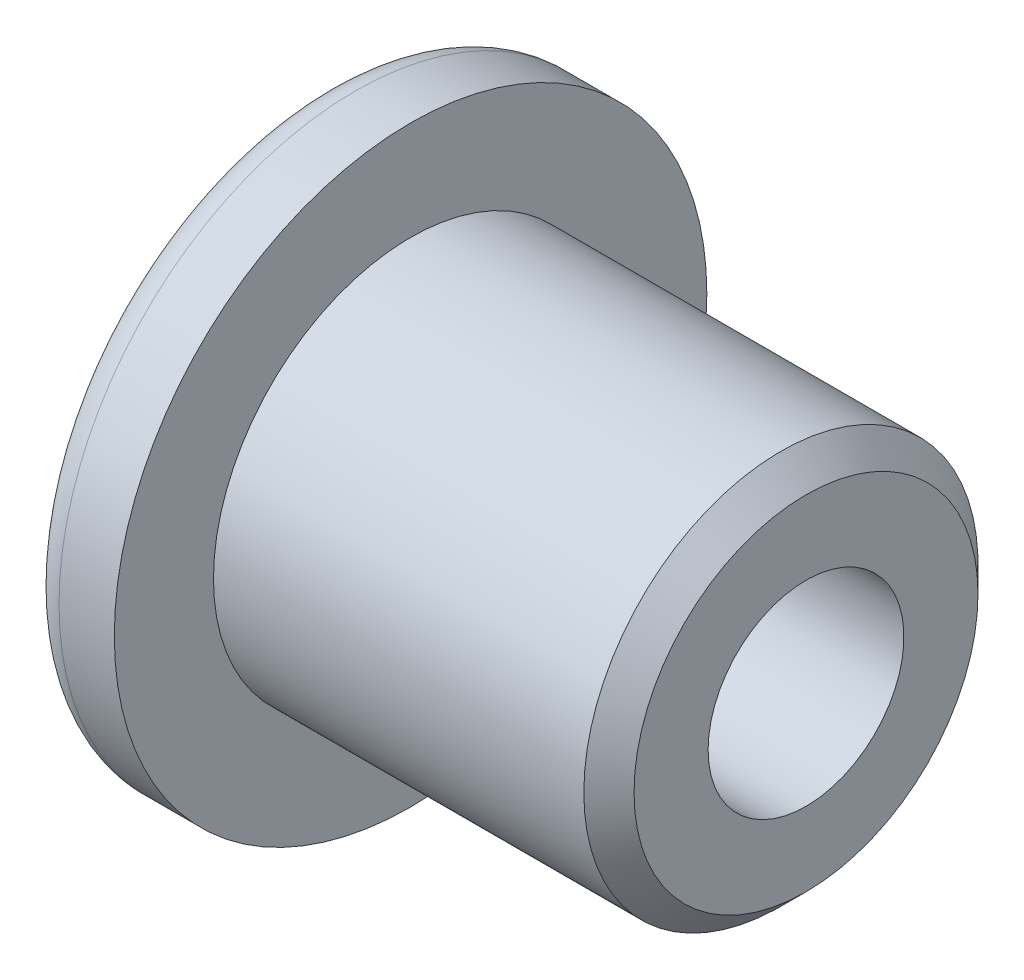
ISO-10303-21;
HEADER;
FILE_DESCRIPTION(('STEP AP214'),'2;1');
FILE_NAME('part.step','',(''),(''),'','','');
FILE_SCHEMA(('AUTOMOTIVE_DESIGN { 1 0 10303 214 1 1 1 1 }'));
ENDSEC;
DATA;
#1=APPLICATION_CONTEXT('core data for automotive mechanical design processes');
#2=APPLICATION_PROTOCOL_DEFINITION('international standard','automotive_design',2000,#1);
#3=PRODUCT_CONTEXT('',#1,'mechanical');
#4=PRODUCT('Part','Part','',(#3));
#5=PRODUCT_RELATED_PRODUCT_CATEGORY('part','',(#4));
#6=PRODUCT_DEFINITION_FORMATION('','',#4);
#7=PRODUCT_DEFINITION_CONTEXT('part definition',#1,'design');
#8=PRODUCT_DEFINITION('design','',#6,#7);
#9=PRODUCT_DEFINITION_SHAPE('','',#8);
#10=(LENGTH_UNIT() NAMED_UNIT(*) SI_UNIT(.MILLI.,.METRE.));
#11=(NAMED_UNIT(*) PLANE_ANGLE_UNIT() SI_UNIT($,.RADIAN.));
#12=(NAMED_UNIT(*) SI_UNIT($,.STERADIAN.) SOLID_ANGLE_UNIT());
#13=UNCERTAINTY_MEASURE_WITH_UNIT(LENGTH_MEASURE(1.E-05),#10,'distance_accuracy_value','');
#14=(GEOMETRIC_REPRESENTATION_CONTEXT(3) GLOBAL_UNCERTAINTY_ASSIGNED_CONTEXT((#13)) GLOBAL_UNIT_ASSIGNED_CONTEXT((#10,
#11,#12)) REPRESENTATION_CONTEXT('',''));
#15=CARTESIAN_POINT('',(0.,0.,0.));
#16=DIRECTION('',(0.,0.,1.));
#17=DIRECTION('',(1.,0.,0.));
#18=AXIS2_PLACEMENT_3D('',#15,#16,#17);
#19=CARTESIAN_POINT('',(0.,1.9812,0.));
#20=DIRECTION('',(1.,0.,0.));
#21=DIRECTION('',(0.,0.,-1.));
#22=AXIS2_PLACEMENT_3D('',#19,#20,#21);
#23=PLANE('',#22);
#24=CARTESIAN_POINT('',(0.,0.,0.));
#25=DIRECTION('',(-1.,0.,0.));
#26=DIRECTION('',(0.,0.,1.));
#27=AXIS2_PLACEMENT_3D('',#24,#25,#26);
#28=CIRCLE('',#27,3.81);
#29=CARTESIAN_POINT('',(0.,0.,3.81));
#30=VERTEX_POINT('',#29);
#31=EDGE_CURVE('E150',#30,#30,#28,.T.);
#32=ORIENTED_EDGE('',*,*,#31,.T.);
#33=EDGE_LOOP('',(#32));
#34=FACE_BOUND('',#33,.T.);
#35=DIRECTION('',(0.,-0.866025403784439,-0.5));
#36=VECTOR('',#35,1.);
#37=CARTESIAN_POINT('',(0.,0.,2.87428058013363));
#38=LINE('',#37,#36);
#39=CARTESIAN_POINT('',(0.,0.,2.87428058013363));
#40=VERTEX_POINT('',#39);
#41=CARTESIAN_POINT('',(0.,-2.4892,1.43714029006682));
#42=VERTEX_POINT('',#41);
#43=EDGE_CURVE('E48',#40,#42,#38,.T.);
#44=ORIENTED_EDGE('',*,*,#43,.T.);
#45=DIRECTION('',(0.,0.,-1.));
#46=VECTOR('',#45,1.);
#47=CARTESIAN_POINT('',(0.,-2.4892,1.43714029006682));
#48=LINE('',#47,#46);
#49=CARTESIAN_POINT('',(0.,-2.4892,-1.43714029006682));
#50=VERTEX_POINT('',#49);
#51=EDGE_CURVE('E120',#42,#50,#48,.T.);
#52=ORIENTED_EDGE('',*,*,#51,.T.);
#53=DIRECTION('',(0.,0.866025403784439,-0.5));
#54=VECTOR('',#53,1.);
#55=CARTESIAN_POINT('',(0.,-2.4892,-1.43714029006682));
#56=LINE('',#55,#54);
#57=CARTESIAN_POINT('',(0.,0.,-2.87428058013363));
#58=VERTEX_POINT('',#57);
#59=EDGE_CURVE('E123',#50,#58,#56,.T.);
#60=ORIENTED_EDGE('',*,*,#59,.T.);
#61=DIRECTION('',(0.,0.866025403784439,0.5));
#62=VECTOR('',#61,1.);
#63=CARTESIAN_POINT('',(0.,0.,-2.87428058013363));
#64=LINE('',#63,#62);
#65=CARTESIAN_POINT('',(0.,2.4892,-1.43714029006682));
#66=VERTEX_POINT('',#65);
#67=EDGE_CURVE('E126',#58,#66,#64,.T.);
#68=ORIENTED_EDGE('',*,*,#67,.T.);
#69=DIRECTION('',(0.,0.,1.));
#70=VECTOR('',#69,1.);
#71=CARTESIAN_POINT('',(0.,2.4892,-1.43714029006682));
#72=LINE('',#71,#70);
#73=CARTESIAN_POINT('',(0.,2.4892,1.43714029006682));
#74=VERTEX_POINT('',#73);
#75=EDGE_CURVE('E109',#66,#74,#72,.T.);
#76=ORIENTED_EDGE('',*,*,#75,.T.);
#77=DIRECTION('',(0.,-0.866025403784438,0.5));
#78=VECTOR('',#77,1.);
#79=CARTESIAN_POINT('',(0.,2.4892,1.43714029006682));
#80=LINE('',#79,#78);
#81=EDGE_CURVE('E129',#74,#40,#80,.T.);
#82=ORIENTED_EDGE('',*,*,#81,.T.);
#83=EDGE_LOOP('',(#44,#52,#60,#68,#76,#82));
#84=FACE_BOUND('',#83,.T.);
#85=ADVANCED_FACE('F33',(#34,#84),#23,.F.);
#86=CARTESIAN_POINT('',(0.,0.,0.));
#87=DIRECTION('',(-1.,0.,0.));
#88=DIRECTION('',(0.,0.,1.));
#89=AXIS2_PLACEMENT_3D('',#86,#87,#88);
#90=CYLINDRICAL_SURFACE('',#89,1.9812);
#91=CARTESIAN_POINT('',(5.08,0.,0.));
#92=DIRECTION('',(1.,0.,0.));
#93=DIRECTION('',(0.,0.,-1.));
#94=AXIS2_PLACEMENT_3D('',#91,#92,#93);
#95=CIRCLE('',#94,1.9812);
#96=CARTESIAN_POINT('',(5.08,0.,-1.9812));
#97=VERTEX_POINT('',#96);
#98=EDGE_CURVE('E140',#97,#97,#95,.F.);
#99=ORIENTED_EDGE('',*,*,#98,.T.);
#100=EDGE_LOOP('',(#99));
#101=FACE_BOUND('',#100,.T.);
#102=CARTESIAN_POINT('',(10.541,0.,0.));
#103=DIRECTION('',(-1.,0.,0.));
#104=DIRECTION('',(0.,0.,1.));
#105=AXIS2_PLACEMENT_3D('',#102,#103,#104);
#106=CIRCLE('',#105,1.9812);
#107=CARTESIAN_POINT('',(10.541,0.,1.9812));
#108=VERTEX_POINT('',#107);
#109=EDGE_CURVE('E141',#108,#108,#106,.T.);
#110=ORIENTED_EDGE('',*,*,#109,.F.);
#111=EDGE_LOOP('',(#110));
#112=FACE_BOUND('',#111,.T.);
#113=ADVANCED_FACE('F176',(#101,#112),#90,.F.);
#114=CARTESIAN_POINT('',(1.016,0.,0.));
#115=DIRECTION('',(1.,0.,0.));
#116=DIRECTION('',(0.,0.,-1.));
#117=AXIS2_PLACEMENT_3D('',#114,#115,#116);
#118=CONICAL_SURFACE('',#117,5.9944,1.13544305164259);
#119=CARTESIAN_POINT('',(0.845208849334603,0.,0.));
#120=DIRECTION('',(-1.,0.,0.));
#121=DIRECTION('',(0.,0.,1.));
#122=AXIS2_PLACEMENT_3D('',#119,#120,#121);
#123=CIRCLE('',#122,5.6271990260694);
#124=CARTESIAN_POINT('',(0.845208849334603,0.,5.6271990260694));
#125=VERTEX_POINT('',#124);
#126=EDGE_CURVE('E153',#125,#125,#123,.T.);
#127=ORIENTED_EDGE('',*,*,#126,.T.);
#128=EDGE_LOOP('',(#127));
#129=FACE_BOUND('',#128,.T.);
#130=ORIENTED_EDGE('',*,*,#31,.F.);
#131=EDGE_LOOP('',(#130));
#132=FACE_BOUND('',#131,.T.);
#133=ADVANCED_FACE('F182',(#129,#132),#118,.T.);
#134=CARTESIAN_POINT('',(0.,0.,0.));
#135=DIRECTION('',(-1.,0.,0.));
#136=DIRECTION('',(0.,0.,1.));
#137=AXIS2_PLACEMENT_3D('',#134,#135,#136);
#138=CYLINDRICAL_SURFACE('',#137,5.9944);
#139=CARTESIAN_POINT('',(1.42097675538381,0.,0.));
#140=DIRECTION('',(1.,0.,0.));
#141=DIRECTION('',(0.,0.,-1.));
#142=AXIS2_PLACEMENT_3D('',#139,#140,#141);
#143=CIRCLE('',#142,5.9944);
#144=CARTESIAN_POINT('',(1.42097675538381,0.,-5.9944));
#145=VERTEX_POINT('',#144);
#146=EDGE_CURVE('E158',#145,#145,#143,.T.);
#147=ORIENTED_EDGE('',*,*,#146,.T.);
#148=EDGE_LOOP('',(#147));
#149=FACE_BOUND('',#148,.T.);
#150=CARTESIAN_POINT('',(2.54,0.,0.));
#151=DIRECTION('',(-1.,0.,0.));
#152=DIRECTION('',(0.,0.,1.));
#153=AXIS2_PLACEMENT_3D('',#150,#151,#152);
#154=CIRCLE('',#153,5.9944);
#155=CARTESIAN_POINT('',(2.54,0.,5.9944));
#156=VERTEX_POINT('',#155);
#157=EDGE_CURVE('E147',#156,#156,#154,.T.);
#158=ORIENTED_EDGE('',*,*,#157,.T.);
#159=EDGE_LOOP('',(#158));
#160=FACE_BOUND('',#159,.T.);
#161=ADVANCED_FACE('F189',(#149,#160),#138,.T.);
#162=CARTESIAN_POINT('',(2.54,5.9944,0.));
#163=DIRECTION('',(-1.,0.,0.));
#164=DIRECTION('',(0.,0.,1.));
#165=AXIS2_PLACEMENT_3D('',#162,#163,#164);
#166=PLANE('',#165);
#167=ORIENTED_EDGE('',*,*,#157,.F.);
#168=EDGE_LOOP('',(#167));
#169=FACE_BOUND('',#168,.T.);
#170=CARTESIAN_POINT('',(2.54,0.,0.));
#171=DIRECTION('',(-1.,0.,0.));
#172=DIRECTION('',(0.,0.,1.));
#173=AXIS2_PLACEMENT_3D('',#170,#171,#172);
#174=CIRCLE('',#173,3.9878);
#175=CARTESIAN_POINT('',(2.54,0.,3.9878));
#176=VERTEX_POINT('',#175);
#177=EDGE_CURVE('E144',#176,#176,#174,.T.);
#178=ORIENTED_EDGE('',*,*,#177,.T.);
#179=EDGE_LOOP('',(#178));
#180=FACE_BOUND('',#179,.T.);
#181=ADVANCED_FACE('F193',(#169,#180),#166,.F.);
#182=CARTESIAN_POINT('',(0.,0.,0.));
#183=DIRECTION('',(-1.,0.,0.));
#184=DIRECTION('',(0.,0.,1.));
#185=AXIS2_PLACEMENT_3D('',#182,#183,#184);
#186=CYLINDRICAL_SURFACE('',#185,3.9878);
#187=CARTESIAN_POINT('',(10.033,0.,0.));
#188=DIRECTION('',(-1.,0.,0.));
#189=DIRECTION('',(0.,0.,1.));
#190=AXIS2_PLACEMENT_3D('',#187,#188,#189);
#191=CIRCLE('',#190,3.9878);
#192=CARTESIAN_POINT('',(10.033,0.,3.9878));
#193=VERTEX_POINT('',#192);
#194=EDGE_CURVE('E41',#193,#193,#191,.T.);
#195=ORIENTED_EDGE('',*,*,#194,.T.);
#196=EDGE_LOOP('',(#195));
#197=FACE_BOUND('',#196,.T.);
#198=ORIENTED_EDGE('',*,*,#177,.F.);
#199=EDGE_LOOP('',(#198));
#200=FACE_BOUND('',#199,.T.);
#201=ADVANCED_FACE('F163',(#197,#200),#186,.T.);
#202=CARTESIAN_POINT('',(10.541,3.9878,0.));
#203=DIRECTION('',(-1.,0.,0.));
#204=DIRECTION('',(0.,0.,1.));
#205=AXIS2_PLACEMENT_3D('',#202,#203,#204);
#206=PLANE('',#205);
#207=CARTESIAN_POINT('',(10.541,0.,0.));
#208=DIRECTION('',(-1.,0.,0.));
#209=DIRECTION('',(0.,0.,1.));
#210=AXIS2_PLACEMENT_3D('',#207,#208,#209);
#211=CIRCLE('',#210,3.4798);
#212=CARTESIAN_POINT('',(10.541,0.,3.4798));
#213=VERTEX_POINT('',#212);
#214=EDGE_CURVE('E11',#213,#213,#211,.F.);
#215=ORIENTED_EDGE('',*,*,#214,.T.);
#216=EDGE_LOOP('',(#215));
#217=FACE_BOUND('',#216,.T.);
#218=ORIENTED_EDGE('',*,*,#109,.T.);
#219=EDGE_LOOP('',(#218));
#220=FACE_BOUND('',#219,.T.);
#221=ADVANCED_FACE('F200',(#217,#220),#206,.F.);
#222=CARTESIAN_POINT('',(5.08,0.,0.));
#223=DIRECTION('',(1.,0.,0.));
#224=DIRECTION('',(0.,0.,-1.));
#225=AXIS2_PLACEMENT_3D('',#222,#223,#224);
#226=PLANE('',#225);
#227=DIRECTION('',(0.,-0.866025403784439,-0.5));
#228=VECTOR('',#227,1.);
#229=CARTESIAN_POINT('',(5.08,0.,2.87428058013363));
#230=LINE('',#229,#228);
#231=CARTESIAN_POINT('',(5.08,0.,2.87428058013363));
#232=VERTEX_POINT('',#231);
#233=CARTESIAN_POINT('',(5.08,-2.4892,1.43714029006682));
#234=VERTEX_POINT('',#233);
#235=EDGE_CURVE('E132',#232,#234,#230,.T.);
#236=ORIENTED_EDGE('',*,*,#235,.F.);
#237=DIRECTION('',(0.,-0.866025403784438,0.5));
#238=VECTOR('',#237,1.);
#239=CARTESIAN_POINT('',(5.08,2.4892,1.43714029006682));
#240=LINE('',#239,#238);
#241=CARTESIAN_POINT('',(5.08,2.4892,1.43714029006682));
#242=VERTEX_POINT('',#241);
#243=EDGE_CURVE('E56',#242,#232,#240,.T.);
#244=ORIENTED_EDGE('',*,*,#243,.F.);
#245=DIRECTION('',(0.,0.,1.));
#246=VECTOR('',#245,1.);
#247=CARTESIAN_POINT('',(5.08,2.4892,-1.43714029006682));
#248=LINE('',#247,#246);
#249=CARTESIAN_POINT('',(5.08,2.4892,-1.43714029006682));
#250=VERTEX_POINT('',#249);
#251=EDGE_CURVE('E104',#250,#242,#248,.T.);
#252=ORIENTED_EDGE('',*,*,#251,.F.);
#253=DIRECTION('',(0.,0.866025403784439,0.5));
#254=VECTOR('',#253,1.);
#255=CARTESIAN_POINT('',(5.08,0.,-2.87428058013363));
#256=LINE('',#255,#254);
#257=CARTESIAN_POINT('',(5.08,0.,-2.87428058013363));
#258=VERTEX_POINT('',#257);
#259=EDGE_CURVE('E97',#258,#250,#256,.T.);
#260=ORIENTED_EDGE('',*,*,#259,.F.);
#261=DIRECTION('',(0.,0.866025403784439,-0.5));
#262=VECTOR('',#261,1.);
#263=CARTESIAN_POINT('',(5.08,-2.4892,-1.43714029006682));
#264=LINE('',#263,#262);
#265=CARTESIAN_POINT('',(5.08,-2.4892,-1.43714029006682));
#266=VERTEX_POINT('',#265);
#267=EDGE_CURVE('E105',#266,#258,#264,.T.);
#268=ORIENTED_EDGE('',*,*,#267,.F.);
#269=DIRECTION('',(0.,0.,-1.));
#270=VECTOR('',#269,1.);
#271=CARTESIAN_POINT('',(5.08,-2.4892,1.43714029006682));
#272=LINE('',#271,#270);
#273=EDGE_CURVE('E87',#234,#266,#272,.T.);
#274=ORIENTED_EDGE('',*,*,#273,.F.);
#275=EDGE_LOOP('',(#236,#244,#252,#260,#268,#274));
#276=FACE_BOUND('',#275,.T.);
#277=ORIENTED_EDGE('',*,*,#98,.F.);
#278=EDGE_LOOP('',(#277));
#279=FACE_BOUND('',#278,.T.);
#280=ADVANCED_FACE('F112',(#276,#279),#226,.F.);
#281=CARTESIAN_POINT('',(5.08,0.,2.87428058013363));
#282=DIRECTION('',(0.,0.5,-0.866025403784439));
#283=DIRECTION('',(0.,0.866025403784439,0.5));
#284=AXIS2_PLACEMENT_3D('',#281,#282,#283);
#285=PLANE('',#284);
#286=ORIENTED_EDGE('',*,*,#43,.F.);
#287=DIRECTION('',(-1.,0.,0.));
#288=VECTOR('',#287,1.);
#289=CARTESIAN_POINT('',(5.08,0.,2.87428058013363));
#290=LINE('',#289,#288);
#291=EDGE_CURVE('E115',#232,#40,#290,.T.);
#292=ORIENTED_EDGE('',*,*,#291,.F.);
#293=ORIENTED_EDGE('',*,*,#235,.T.);
#294=DIRECTION('',(-1.,0.,0.));
#295=VECTOR('',#294,1.);
#296=CARTESIAN_POINT('',(5.08,-2.4892,1.43714029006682));
#297=LINE('',#296,#295);
#298=EDGE_CURVE('E138',#234,#42,#297,.T.);
#299=ORIENTED_EDGE('',*,*,#298,.T.);
#300=EDGE_LOOP('',(#286,#292,#293,#299));
#301=FACE_BOUND('',#300,.T.);
#302=ADVANCED_FACE('F204',(#301),#285,.T.);
#303=CARTESIAN_POINT('',(5.08,-2.4892,1.43714029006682));
#304=DIRECTION('',(0.,1.,0.));
#305=DIRECTION('',(0.,0.,1.));
#306=AXIS2_PLACEMENT_3D('',#303,#304,#305);
#307=PLANE('',#306);
#308=ORIENTED_EDGE('',*,*,#51,.F.);
#309=ORIENTED_EDGE('',*,*,#298,.F.);
#310=ORIENTED_EDGE('',*,*,#273,.T.);
#311=DIRECTION('',(-1.,0.,0.));
#312=VECTOR('',#311,1.);
#313=CARTESIAN_POINT('',(5.08,-2.4892,-1.43714029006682));
#314=LINE('',#313,#312);
#315=EDGE_CURVE('E136',#266,#50,#314,.T.);
#316=ORIENTED_EDGE('',*,*,#315,.T.);
#317=EDGE_LOOP('',(#308,#309,#310,#316));
#318=FACE_BOUND('',#317,.T.);
#319=ADVANCED_FACE('F207',(#318),#307,.T.);
#320=CARTESIAN_POINT('',(5.08,-2.4892,-1.43714029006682));
#321=DIRECTION('',(0.,0.5,0.866025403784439));
#322=DIRECTION('',(0.,-0.866025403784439,0.5));
#323=AXIS2_PLACEMENT_3D('',#320,#321,#322);
#324=PLANE('',#323);
#325=ORIENTED_EDGE('',*,*,#59,.F.);
#326=ORIENTED_EDGE('',*,*,#315,.F.);
#327=ORIENTED_EDGE('',*,*,#267,.T.);
#328=DIRECTION('',(-1.,0.,0.));
#329=VECTOR('',#328,1.);
#330=CARTESIAN_POINT('',(5.08,0.,-2.87428058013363));
#331=LINE('',#330,#329);
#332=EDGE_CURVE('E102',#258,#58,#331,.T.);
#333=ORIENTED_EDGE('',*,*,#332,.T.);
#334=EDGE_LOOP('',(#325,#326,#327,#333));
#335=FACE_BOUND('',#334,.T.);
#336=ADVANCED_FACE('F210',(#335),#324,.T.);
#337=CARTESIAN_POINT('',(5.08,0.,-2.87428058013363));
#338=DIRECTION('',(0.,-0.5,0.866025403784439));
#339=DIRECTION('',(0.,-0.866025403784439,-0.5));
#340=AXIS2_PLACEMENT_3D('',#337,#338,#339);
#341=PLANE('',#340);
#342=ORIENTED_EDGE('',*,*,#67,.F.);
#343=ORIENTED_EDGE('',*,*,#332,.F.);
#344=ORIENTED_EDGE('',*,*,#259,.T.);
#345=DIRECTION('',(-1.,0.,0.));
#346=VECTOR('',#345,1.);
#347=CARTESIAN_POINT('',(5.08,2.4892,-1.43714029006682));
#348=LINE('',#347,#346);
#349=EDGE_CURVE('E101',#250,#66,#348,.T.);
#350=ORIENTED_EDGE('',*,*,#349,.T.);
#351=EDGE_LOOP('',(#342,#343,#344,#350));
#352=FACE_BOUND('',#351,.T.);
#353=ADVANCED_FACE('F100',(#352),#341,.T.);
#354=CARTESIAN_POINT('',(5.08,2.4892,-1.43714029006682));
#355=DIRECTION('',(0.,-1.,0.));
#356=DIRECTION('',(0.,0.,-1.));
#357=AXIS2_PLACEMENT_3D('',#354,#355,#356);
#358=PLANE('',#357);
#359=ORIENTED_EDGE('',*,*,#75,.F.);
#360=ORIENTED_EDGE('',*,*,#349,.F.);
#361=ORIENTED_EDGE('',*,*,#251,.T.);
#362=DIRECTION('',(-1.,0.,0.));
#363=VECTOR('',#362,1.);
#364=CARTESIAN_POINT('',(5.08,2.4892,1.43714029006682));
#365=LINE('',#364,#363);
#366=EDGE_CURVE('E78',#242,#74,#365,.T.);
#367=ORIENTED_EDGE('',*,*,#366,.T.);
#368=EDGE_LOOP('',(#359,#360,#361,#367));
#369=FACE_BOUND('',#368,.T.);
#370=ADVANCED_FACE('F107',(#369),#358,.T.);
#371=CARTESIAN_POINT('',(5.08,2.4892,1.43714029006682));
#372=DIRECTION('',(0.,-0.5,-0.866025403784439));
#373=DIRECTION('',(0.,0.866025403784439,-0.5));
#374=AXIS2_PLACEMENT_3D('',#371,#372,#373);
#375=PLANE('',#374);
#376=ORIENTED_EDGE('',*,*,#81,.F.);
#377=ORIENTED_EDGE('',*,*,#366,.F.);
#378=ORIENTED_EDGE('',*,*,#243,.T.);
#379=ORIENTED_EDGE('',*,*,#291,.T.);
#380=EDGE_LOOP('',(#376,#377,#378,#379));
#381=FACE_BOUND('',#380,.T.);
#382=ADVANCED_FACE('F172',(#381),#375,.T.);
#383=CARTESIAN_POINT('',(1.42097675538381,0.,0.));
#384=DIRECTION('',(1.,0.,0.));
#385=DIRECTION('',(0.,0.,-1.));
#386=AXIS2_PLACEMENT_3D('',#383,#384,#385);
#387=TOROIDAL_SURFACE('',#386,5.3594,0.635);
#388=ORIENTED_EDGE('',*,*,#146,.F.);
#389=EDGE_LOOP('',(#388));
#390=FACE_BOUND('',#389,.T.);
#391=ORIENTED_EDGE('',*,*,#126,.F.);
#392=EDGE_LOOP('',(#391));
#393=FACE_BOUND('',#392,.T.);
#394=ADVANCED_FACE('F167',(#390,#393),#387,.T.);
#395=CARTESIAN_POINT('',(10.033,0.,0.));
#396=DIRECTION('',(-1.,0.,0.));
#397=DIRECTION('',(0.,0.,1.));
#398=AXIS2_PLACEMENT_3D('',#395,#396,#397);
#399=CONICAL_SURFACE('',#398,3.9878,0.785398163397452);
#400=ORIENTED_EDGE('',*,*,#214,.F.);
#401=EDGE_LOOP('',(#400));
#402=FACE_BOUND('',#401,.T.);
#403=ORIENTED_EDGE('',*,*,#194,.F.);
#404=EDGE_LOOP('',(#403));
#405=FACE_BOUND('',#404,.T.);
#406=ADVANCED_FACE('F35',(#402,#405),#399,.T.);
#407=CLOSED_SHELL('',(#85,#113,#133,#161,#181,#201,#221,#280,#302,#319,#336,#353,#370,#382,#394,#406));
#408=MANIFOLD_SOLID_BREP('B2',#407);
#409=ADVANCED_BREP_SHAPE_REPRESENTATION('',(#18,#408),#14);
#410=SHAPE_DEFINITION_REPRESENTATION(#9,#409);
ENDSEC;
END-ISO-10303-21;
